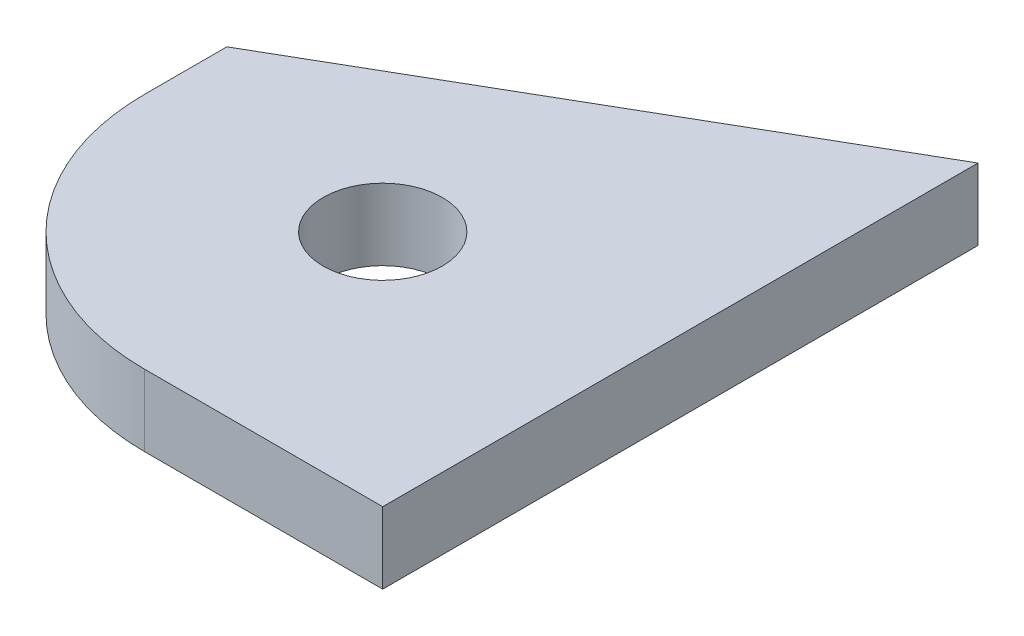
ISO-10303-21;
HEADER;
FILE_DESCRIPTION(('STEP AP214'),'2;1');
FILE_NAME('part.step','',(''),(''),'','','');
FILE_SCHEMA(('AUTOMOTIVE_DESIGN { 1 0 10303 214 1 1 1 1 }'));
ENDSEC;
DATA;
#1=APPLICATION_CONTEXT('core data for automotive mechanical design processes');
#2=APPLICATION_PROTOCOL_DEFINITION('international standard','automotive_design',2000,#1);
#3=PRODUCT_CONTEXT('',#1,'mechanical');
#4=PRODUCT('Part','Part','',(#3));
#5=PRODUCT_RELATED_PRODUCT_CATEGORY('part','',(#4));
#6=PRODUCT_DEFINITION_FORMATION('','',#4);
#7=PRODUCT_DEFINITION_CONTEXT('part definition',#1,'design');
#8=PRODUCT_DEFINITION('design','',#6,#7);
#9=PRODUCT_DEFINITION_SHAPE('','',#8);
#10=(LENGTH_UNIT() NAMED_UNIT(*) SI_UNIT(.MILLI.,.METRE.));
#11=(NAMED_UNIT(*) PLANE_ANGLE_UNIT() SI_UNIT($,.RADIAN.));
#12=(NAMED_UNIT(*) SI_UNIT($,.STERADIAN.) SOLID_ANGLE_UNIT());
#13=UNCERTAINTY_MEASURE_WITH_UNIT(LENGTH_MEASURE(1.E-05),#10,'distance_accuracy_value','');
#14=(GEOMETRIC_REPRESENTATION_CONTEXT(3) GLOBAL_UNCERTAINTY_ASSIGNED_CONTEXT((#13)) GLOBAL_UNIT_ASSIGNED_CONTEXT((#10,
#11,#12)) REPRESENTATION_CONTEXT('',''));
#15=CARTESIAN_POINT('',(0.,0.,0.));
#16=DIRECTION('',(0.,0.,1.));
#17=DIRECTION('',(1.,0.,0.));
#18=AXIS2_PLACEMENT_3D('',#15,#16,#17);
#19=CARTESIAN_POINT('',(-10.,3.,15.));
#20=DIRECTION('',(0.,1.,0.));
#21=DIRECTION('',(0.,0.,1.));
#22=AXIS2_PLACEMENT_3D('',#19,#20,#21);
#23=PLANE('',#22);
#24=DIRECTION('',(-0.86602540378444,0.,0.499999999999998));
#25=VECTOR('',#24,1.);
#26=CARTESIAN_POINT('',(0.,3.,0.));
#27=LINE('',#26,#25);
#28=CARTESIAN_POINT('',(0.,3.,0.));
#29=VERTEX_POINT('',#28);
#30=CARTESIAN_POINT('',(-20.,3.,11.5470053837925));
#31=VERTEX_POINT('',#30);
#32=EDGE_CURVE('E108',#29,#31,#27,.T.);
#33=ORIENTED_EDGE('',*,*,#32,.T.);
#34=DIRECTION('',(0.,0.,1.));
#35=VECTOR('',#34,1.);
#36=CARTESIAN_POINT('',(-20.,3.,15.));
#37=LINE('',#36,#35);
#38=CARTESIAN_POINT('',(-20.,3.,15.));
#39=VERTEX_POINT('',#38);
#40=EDGE_CURVE('E91',#31,#39,#37,.T.);
#41=ORIENTED_EDGE('',*,*,#40,.T.);
#42=CARTESIAN_POINT('',(-10.,3.,15.));
#43=DIRECTION('',(0.,1.,0.));
#44=DIRECTION('',(0.,0.,1.));
#45=AXIS2_PLACEMENT_3D('',#42,#43,#44);
#46=CIRCLE('',#45,10.);
#47=CARTESIAN_POINT('',(-10.,3.,25.));
#48=VERTEX_POINT('',#47);
#49=EDGE_CURVE('E111',#39,#48,#46,.T.);
#50=ORIENTED_EDGE('',*,*,#49,.T.);
#51=DIRECTION('',(1.,0.,0.));
#52=VECTOR('',#51,1.);
#53=CARTESIAN_POINT('',(0.,3.,25.));
#54=LINE('',#53,#52);
#55=CARTESIAN_POINT('',(0.,3.,25.));
#56=VERTEX_POINT('',#55);
#57=EDGE_CURVE('E50',#48,#56,#54,.T.);
#58=ORIENTED_EDGE('',*,*,#57,.T.);
#59=DIRECTION('',(0.,0.,-1.));
#60=VECTOR('',#59,1.);
#61=CARTESIAN_POINT('',(0.,3.,0.));
#62=LINE('',#61,#60);
#63=EDGE_CURVE('E45',#56,#29,#62,.T.);
#64=ORIENTED_EDGE('',*,*,#63,.T.);
#65=EDGE_LOOP('',(#33,#41,#50,#58,#64));
#66=FACE_BOUND('',#65,.T.);
#67=CARTESIAN_POINT('',(-10.,3.,15.));
#68=DIRECTION('',(0.,1.,0.));
#69=DIRECTION('',(0.,0.,1.));
#70=AXIS2_PLACEMENT_3D('',#67,#68,#69);
#71=CIRCLE('',#70,2.5);
#72=CARTESIAN_POINT('',(-10.,3.,17.5));
#73=VERTEX_POINT('',#72);
#74=EDGE_CURVE('E96',#73,#73,#71,.T.);
#75=ORIENTED_EDGE('',*,*,#74,.F.);
#76=EDGE_LOOP('',(#75));
#77=FACE_BOUND('',#76,.T.);
#78=ADVANCED_FACE('F30',(#66,#77),#23,.T.);
#79=CARTESIAN_POINT('',(-10.,0.,15.));
#80=DIRECTION('',(0.,1.,0.));
#81=DIRECTION('',(0.,0.,1.));
#82=AXIS2_PLACEMENT_3D('',#79,#80,#81);
#83=PLANE('',#82);
#84=DIRECTION('',(-0.86602540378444,0.,0.499999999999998));
#85=VECTOR('',#84,1.);
#86=CARTESIAN_POINT('',(0.,0.,0.));
#87=LINE('',#86,#85);
#88=CARTESIAN_POINT('',(0.,0.,0.));
#89=VERTEX_POINT('',#88);
#90=CARTESIAN_POINT('',(-20.,0.,11.5470053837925));
#91=VERTEX_POINT('',#90);
#92=EDGE_CURVE('E82',#89,#91,#87,.T.);
#93=ORIENTED_EDGE('',*,*,#92,.F.);
#94=DIRECTION('',(0.,0.,-1.));
#95=VECTOR('',#94,1.);
#96=CARTESIAN_POINT('',(0.,0.,0.));
#97=LINE('',#96,#95);
#98=CARTESIAN_POINT('',(0.,0.,25.));
#99=VERTEX_POINT('',#98);
#100=EDGE_CURVE('E106',#99,#89,#97,.T.);
#101=ORIENTED_EDGE('',*,*,#100,.F.);
#102=DIRECTION('',(1.,0.,0.));
#103=VECTOR('',#102,1.);
#104=CARTESIAN_POINT('',(0.,0.,25.));
#105=LINE('',#104,#103);
#106=CARTESIAN_POINT('',(-10.,0.,25.));
#107=VERTEX_POINT('',#106);
#108=EDGE_CURVE('E104',#107,#99,#105,.T.);
#109=ORIENTED_EDGE('',*,*,#108,.F.);
#110=CARTESIAN_POINT('',(-10.,0.,15.));
#111=DIRECTION('',(0.,1.,0.));
#112=DIRECTION('',(0.,0.,1.));
#113=AXIS2_PLACEMENT_3D('',#110,#111,#112);
#114=CIRCLE('',#113,10.);
#115=CARTESIAN_POINT('',(-20.,0.,15.));
#116=VERTEX_POINT('',#115);
#117=EDGE_CURVE('E84',#116,#107,#114,.T.);
#118=ORIENTED_EDGE('',*,*,#117,.F.);
#119=DIRECTION('',(0.,0.,1.));
#120=VECTOR('',#119,1.);
#121=CARTESIAN_POINT('',(-20.,0.,15.));
#122=LINE('',#121,#120);
#123=EDGE_CURVE('E77',#91,#116,#122,.T.);
#124=ORIENTED_EDGE('',*,*,#123,.F.);
#125=EDGE_LOOP('',(#93,#101,#109,#118,#124));
#126=FACE_BOUND('',#125,.T.);
#127=CARTESIAN_POINT('',(-10.,0.,15.));
#128=DIRECTION('',(0.,1.,0.));
#129=DIRECTION('',(0.,0.,1.));
#130=AXIS2_PLACEMENT_3D('',#127,#128,#129);
#131=CIRCLE('',#130,2.5);
#132=CARTESIAN_POINT('',(-10.,0.,17.5));
#133=VERTEX_POINT('',#132);
#134=EDGE_CURVE('E99',#133,#133,#131,.T.);
#135=ORIENTED_EDGE('',*,*,#134,.T.);
#136=EDGE_LOOP('',(#135));
#137=FACE_BOUND('',#136,.T.);
#138=ADVANCED_FACE('F78',(#126,#137),#83,.F.);
#139=CARTESIAN_POINT('',(0.,3.,0.));
#140=DIRECTION('',(0.499999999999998,0.,0.86602540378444));
#141=DIRECTION('',(0.86602540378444,0.,-0.499999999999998));
#142=AXIS2_PLACEMENT_3D('',#139,#140,#141);
#143=PLANE('',#142);
#144=ORIENTED_EDGE('',*,*,#92,.T.);
#145=DIRECTION('',(0.,-1.,0.));
#146=VECTOR('',#145,1.);
#147=CARTESIAN_POINT('',(-20.,3.,11.5470053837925));
#148=LINE('',#147,#146);
#149=EDGE_CURVE('E11',#31,#91,#148,.T.);
#150=ORIENTED_EDGE('',*,*,#149,.F.);
#151=ORIENTED_EDGE('',*,*,#32,.F.);
#152=DIRECTION('',(0.,-1.,0.));
#153=VECTOR('',#152,1.);
#154=CARTESIAN_POINT('',(0.,3.,0.));
#155=LINE('',#154,#153);
#156=EDGE_CURVE('E95',#29,#89,#155,.T.);
#157=ORIENTED_EDGE('',*,*,#156,.T.);
#158=EDGE_LOOP('',(#144,#150,#151,#157));
#159=FACE_BOUND('',#158,.T.);
#160=ADVANCED_FACE('F32',(#159),#143,.F.);
#161=CARTESIAN_POINT('',(-20.,3.,15.));
#162=DIRECTION('',(1.,0.,0.));
#163=DIRECTION('',(0.,0.,-1.));
#164=AXIS2_PLACEMENT_3D('',#161,#162,#163);
#165=PLANE('',#164);
#166=ORIENTED_EDGE('',*,*,#123,.T.);
#167=DIRECTION('',(0.,-1.,0.));
#168=VECTOR('',#167,1.);
#169=CARTESIAN_POINT('',(-20.,3.,15.));
#170=LINE('',#169,#168);
#171=EDGE_CURVE('E38',#39,#116,#170,.T.);
#172=ORIENTED_EDGE('',*,*,#171,.F.);
#173=ORIENTED_EDGE('',*,*,#40,.F.);
#174=ORIENTED_EDGE('',*,*,#149,.T.);
#175=EDGE_LOOP('',(#166,#172,#173,#174));
#176=FACE_BOUND('',#175,.T.);
#177=ADVANCED_FACE('F90',(#176),#165,.F.);
#178=CARTESIAN_POINT('',(-10.,3.,15.));
#179=DIRECTION('',(0.,-1.,0.));
#180=DIRECTION('',(0.,0.,-1.));
#181=AXIS2_PLACEMENT_3D('',#178,#179,#180);
#182=CYLINDRICAL_SURFACE('',#181,10.);
#183=ORIENTED_EDGE('',*,*,#117,.T.);
#184=DIRECTION('',(0.,-1.,0.));
#185=VECTOR('',#184,1.);
#186=CARTESIAN_POINT('',(-10.,3.,25.));
#187=LINE('',#186,#185);
#188=EDGE_CURVE('E119',#48,#107,#187,.T.);
#189=ORIENTED_EDGE('',*,*,#188,.F.);
#190=ORIENTED_EDGE('',*,*,#49,.F.);
#191=ORIENTED_EDGE('',*,*,#171,.T.);
#192=EDGE_LOOP('',(#183,#189,#190,#191));
#193=FACE_BOUND('',#192,.T.);
#194=ADVANCED_FACE('F123',(#193),#182,.T.);
#195=CARTESIAN_POINT('',(0.,3.,25.));
#196=DIRECTION('',(0.,0.,-1.));
#197=DIRECTION('',(-1.,0.,0.));
#198=AXIS2_PLACEMENT_3D('',#195,#196,#197);
#199=PLANE('',#198);
#200=ORIENTED_EDGE('',*,*,#108,.T.);
#201=DIRECTION('',(0.,-1.,0.));
#202=VECTOR('',#201,1.);
#203=CARTESIAN_POINT('',(0.,3.,25.));
#204=LINE('',#203,#202);
#205=EDGE_CURVE('E116',#56,#99,#204,.T.);
#206=ORIENTED_EDGE('',*,*,#205,.F.);
#207=ORIENTED_EDGE('',*,*,#57,.F.);
#208=ORIENTED_EDGE('',*,*,#188,.T.);
#209=EDGE_LOOP('',(#200,#206,#207,#208));
#210=FACE_BOUND('',#209,.T.);
#211=ADVANCED_FACE('F145',(#210),#199,.F.);
#212=CARTESIAN_POINT('',(0.,3.,0.));
#213=DIRECTION('',(-1.,0.,0.));
#214=DIRECTION('',(0.,0.,1.));
#215=AXIS2_PLACEMENT_3D('',#212,#213,#214);
#216=PLANE('',#215);
#217=ORIENTED_EDGE('',*,*,#100,.T.);
#218=ORIENTED_EDGE('',*,*,#156,.F.);
#219=ORIENTED_EDGE('',*,*,#63,.F.);
#220=ORIENTED_EDGE('',*,*,#205,.T.);
#221=EDGE_LOOP('',(#217,#218,#219,#220));
#222=FACE_BOUND('',#221,.T.);
#223=ADVANCED_FACE('F133',(#222),#216,.F.);
#224=CARTESIAN_POINT('',(-10.,3.,15.));
#225=DIRECTION('',(0.,-1.,0.));
#226=DIRECTION('',(0.,0.,-1.));
#227=AXIS2_PLACEMENT_3D('',#224,#225,#226);
#228=CYLINDRICAL_SURFACE('',#227,2.5);
#229=ORIENTED_EDGE('',*,*,#74,.T.);
#230=EDGE_LOOP('',(#229));
#231=FACE_BOUND('',#230,.T.);
#232=ORIENTED_EDGE('',*,*,#134,.F.);
#233=EDGE_LOOP('',(#232));
#234=FACE_BOUND('',#233,.T.);
#235=ADVANCED_FACE('F130',(#231,#234),#228,.F.);
#236=CLOSED_SHELL('',(#78,#138,#160,#177,#194,#211,#223,#235));
#237=MANIFOLD_SOLID_BREP('B2',#236);
#238=ADVANCED_BREP_SHAPE_REPRESENTATION('',(#18,#237),#14);
#239=SHAPE_DEFINITION_REPRESENTATION(#9,#238);
ENDSEC;
END-ISO-10303-21;
